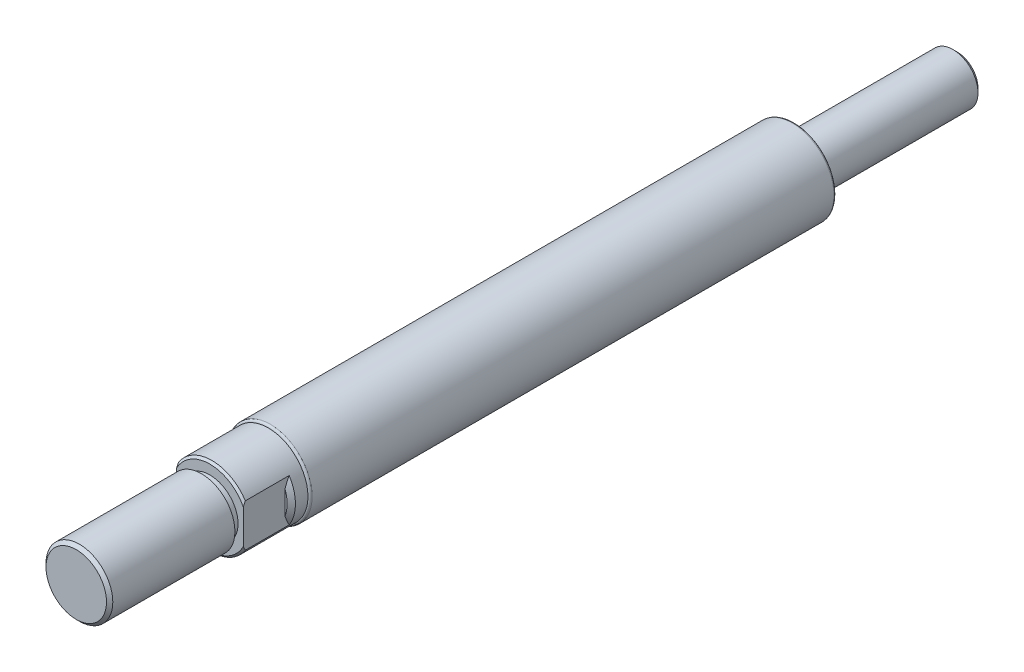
ISO-10303-21;
HEADER;
FILE_DESCRIPTION(('STEP AP214'),'2;1');
FILE_NAME('part.step','',(''),(''),'','','');
FILE_SCHEMA(('AUTOMOTIVE_DESIGN { 1 0 10303 214 1 1 1 1 }'));
ENDSEC;
DATA;
#1=APPLICATION_CONTEXT('core data for automotive mechanical design processes');
#2=APPLICATION_PROTOCOL_DEFINITION('international standard','automotive_design',2000,#1);
#3=PRODUCT_CONTEXT('',#1,'mechanical');
#4=PRODUCT('Part','Part','',(#3));
#5=PRODUCT_RELATED_PRODUCT_CATEGORY('part','',(#4));
#6=PRODUCT_DEFINITION_FORMATION('','',#4);
#7=PRODUCT_DEFINITION_CONTEXT('part definition',#1,'design');
#8=PRODUCT_DEFINITION('design','',#6,#7);
#9=PRODUCT_DEFINITION_SHAPE('','',#8);
#10=(LENGTH_UNIT() NAMED_UNIT(*) SI_UNIT(.MILLI.,.METRE.));
#11=(NAMED_UNIT(*) PLANE_ANGLE_UNIT() SI_UNIT($,.RADIAN.));
#12=(NAMED_UNIT(*) SI_UNIT($,.STERADIAN.) SOLID_ANGLE_UNIT());
#13=UNCERTAINTY_MEASURE_WITH_UNIT(LENGTH_MEASURE(1.E-05),#10,'distance_accuracy_value','');
#14=(GEOMETRIC_REPRESENTATION_CONTEXT(3) GLOBAL_UNCERTAINTY_ASSIGNED_CONTEXT((#13)) GLOBAL_UNIT_ASSIGNED_CONTEXT((#10,
#11,#12)) REPRESENTATION_CONTEXT('',''));
#15=CARTESIAN_POINT('',(0.,0.,0.));
#16=DIRECTION('',(0.,0.,1.));
#17=DIRECTION('',(1.,0.,0.));
#18=AXIS2_PLACEMENT_3D('',#15,#16,#17);
#19=CARTESIAN_POINT('',(0.,0.,-32.));
#20=DIRECTION('',(0.,0.,-1.));
#21=DIRECTION('',(-0.999999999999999,0.,0.));
#22=AXIS2_PLACEMENT_3D('',#19,#20,#21);
#23=CONICAL_SURFACE('',#22,8.99999999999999,0.785398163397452);
#24=CARTESIAN_POINT('',(-8.00000000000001,-12.4805652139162,-37.8244564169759));
#25=CARTESIAN_POINT('',(-8.00000000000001,-12.3224722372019,-37.6913618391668));
#26=CARTESIAN_POINT('',(-8.00000000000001,-12.1640190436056,-37.5586953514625));
#27=CARTESIAN_POINT('',(-8.00000000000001,-11.8463165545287,-37.2943151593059));
#28=CARTESIAN_POINT('',(-8.00000000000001,-11.6870672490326,-37.1626014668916));
#29=CARTESIAN_POINT('',(-8.00000000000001,-11.2079478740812,-36.7689821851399));
#30=CARTESIAN_POINT('',(-8.00000000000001,-10.8867753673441,-36.5086566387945));
#31=CARTESIAN_POINT('',(-8.00000000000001,-10.2380170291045,-35.9914726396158));
#32=CARTESIAN_POINT('',(-8.00000000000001,-9.91040226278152,-35.7346504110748));
#33=CARTESIAN_POINT('',(-8.00000000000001,-9.2500193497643,-35.22775645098));
#34=CARTESIAN_POINT('',(-8.00000000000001,-8.91725166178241,-34.9776841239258));
#35=CARTESIAN_POINT('',(-8.00000000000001,-8.25887278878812,-34.496113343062));
#36=CARTESIAN_POINT('',(-8.00000000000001,-7.93351298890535,-34.2642724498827));
#37=CARTESIAN_POINT('',(-8.00000000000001,-7.27552844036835,-33.810938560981));
#38=CARTESIAN_POINT('',(-8.00000000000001,-6.94290236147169,-33.5894474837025));
#39=CARTESIAN_POINT('',(-8.00000000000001,-6.26956184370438,-33.1607142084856));
#40=CARTESIAN_POINT('',(-8.00000000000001,-5.92886664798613,-32.9534419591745));
#41=CARTESIAN_POINT('',(-8.00000000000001,-5.23689572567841,-32.5574331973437));
#42=CARTESIAN_POINT('',(-8.00000000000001,-4.88562506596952,-32.3686879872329));
#43=CARTESIAN_POINT('',(-8.00000000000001,-4.3738715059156,-32.1166235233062));
#44=CARTESIAN_POINT('',(-8.00000000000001,-4.21844785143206,-32.0429980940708));
#45=CARTESIAN_POINT('',(-8.00000000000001,-3.90514290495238,-31.9011576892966));
#46=CARTESIAN_POINT('',(-8.00000000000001,-3.74726167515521,-31.8329425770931));
#47=CARTESIAN_POINT('',(-8.00000000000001,-3.42918042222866,-31.7027730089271));
#48=CARTESIAN_POINT('',(-8.00000000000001,-3.26898384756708,-31.6408101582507));
#49=CARTESIAN_POINT('',(-8.00000000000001,-2.94603757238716,-31.5238771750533));
#50=CARTESIAN_POINT('',(-8.00000000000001,-2.78328774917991,-31.4689073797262));
#51=CARTESIAN_POINT('',(-8.00000000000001,-2.45268168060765,-31.3660375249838));
#52=CARTESIAN_POINT('',(-8.00000000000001,-2.28478540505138,-31.3182653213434));
#53=CARTESIAN_POINT('',(-8.00000000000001,-1.94668439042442,-31.2318203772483));
#54=CARTESIAN_POINT('',(-8.00000000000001,-1.77648006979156,-31.1931460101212));
#55=CARTESIAN_POINT('',(-8.00000000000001,-1.43315589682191,-31.1256089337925));
#56=CARTESIAN_POINT('',(-8.00000000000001,-1.2600252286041,-31.0968006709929));
#57=CARTESIAN_POINT('',(-8.00000000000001,-0.912189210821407,-31.0499796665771));
#58=CARTESIAN_POINT('',(-8.00000000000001,-0.73748281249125,-31.0319747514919));
#59=CARTESIAN_POINT('',(-8.00000000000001,-0.562330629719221,-31.0197391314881));
#60=B_SPLINE_CURVE_WITH_KNOTS('',3,(#24,#25,#26,#27,#28,#29,#30,#31,#32,#33,#34,#35,#36,#37,#38,
#39,#40,#41,#42,#43,#44,#45,#46,#47,#48,#49,#50,#51,#52,#53,#54,#55,#56,#57,#58,#59),
.UNSPECIFIED.,.F.,.F.,(4,2,2,2,2,2,2,2,2,2,2,2,2,2,2,2,2,4),(0.,0.619972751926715,
1.23995332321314,2.48018539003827,3.72895875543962,4.97762158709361,6.17600476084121,
7.37460919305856,8.5705969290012,9.76602049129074,10.2818793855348,10.7977252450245,
11.3128690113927,11.8280376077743,12.3514878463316,12.8748444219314,13.4010442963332,
13.9276249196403),.UNSPECIFIED.);
#61=CARTESIAN_POINT('',(-8.00000000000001,-5.12347538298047,-32.5));
#62=VERTEX_POINT('',#61);
#63=CARTESIAN_POINT('',(-8.00000000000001,-4.12310562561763,-32.));
#64=VERTEX_POINT('',#63);
#65=EDGE_CURVE('E93',#62,#64,#60,.T.);
#66=ORIENTED_EDGE('',*,*,#65,.F.);
#67=CARTESIAN_POINT('',(0.,0.,-32.5));
#68=DIRECTION('',(0.,0.,-1.));
#69=DIRECTION('',(-0.999999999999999,0.,0.));
#70=AXIS2_PLACEMENT_3D('',#67,#68,#69);
#71=CIRCLE('',#70,9.5);
#72=CARTESIAN_POINT('',(8.00000000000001,-5.12347538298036,-32.5));
#73=VERTEX_POINT('',#72);
#74=EDGE_CURVE('E127',#73,#62,#71,.T.);
#75=ORIENTED_EDGE('',*,*,#74,.F.);
#76=CARTESIAN_POINT('',(8.00000000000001,-0.562330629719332,-31.0197391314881));
#77=CARTESIAN_POINT('',(7.99999999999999,-0.69295357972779,-31.0288830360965));
#78=CARTESIAN_POINT('',(7.99999999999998,-0.823340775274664,-31.0412160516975));
#79=CARTESIAN_POINT('',(7.99999999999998,-1.08335782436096,-31.071992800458));
#80=CARTESIAN_POINT('',(7.99999999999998,-1.21298787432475,-31.0904348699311));
#81=CARTESIAN_POINT('',(7.99999999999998,-1.47102175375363,-31.133125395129));
#82=CARTESIAN_POINT('',(7.99999999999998,-1.59942749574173,-31.1573623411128));
#83=CARTESIAN_POINT('',(7.99999999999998,-1.85508108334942,-31.211315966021));
#84=CARTESIAN_POINT('',(7.99999999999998,-1.98232885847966,-31.2410329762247));
#85=CARTESIAN_POINT('',(7.99999999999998,-2.35920384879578,-31.3371043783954));
#86=CARTESIAN_POINT('',(7.99999999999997,-2.6069577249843,-31.4108917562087));
#87=CARTESIAN_POINT('',(7.99999999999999,-3.09678237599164,-31.5753571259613));
#88=CARTESIAN_POINT('',(8.00000000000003,-3.33885159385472,-31.6660396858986));
#89=CARTESIAN_POINT('',(8.,-3.65836579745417,-31.7964917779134));
#90=CARTESIAN_POINT('',(7.99999999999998,-3.73838694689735,-31.8300828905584));
#91=CARTESIAN_POINT('',(7.99999999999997,-3.89777984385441,-31.8987366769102));
#92=CARTESIAN_POINT('',(7.99999999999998,-3.97715171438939,-31.9337990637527));
#93=CARTESIAN_POINT('',(7.99999999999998,-4.13548600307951,-32.0054007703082));
#94=CARTESIAN_POINT('',(7.99999999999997,-4.21444671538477,-32.0419438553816));
#95=CARTESIAN_POINT('',(7.99999999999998,-4.37174909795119,-32.1163258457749));
#96=CARTESIAN_POINT('',(8.,-4.45009079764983,-32.1541646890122));
#97=CARTESIAN_POINT('',(8.00000000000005,-4.89771562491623,-32.3746464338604));
#98=CARTESIAN_POINT('',(8.,-5.26067807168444,-32.5702240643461));
#99=CARTESIAN_POINT('',(7.99999999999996,-5.97540383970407,-32.9809788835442));
#100=CARTESIAN_POINT('',(7.99999999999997,-6.32716009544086,-33.1961681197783));
#101=CARTESIAN_POINT('',(7.99999999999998,-7.02247411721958,-33.6416036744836));
#102=CARTESIAN_POINT('',(7.99999999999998,-7.36600352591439,-33.8718940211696));
#103=CARTESIAN_POINT('',(7.99999999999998,-8.04542815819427,-34.3432410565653));
#104=CARTESIAN_POINT('',(7.99999999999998,-8.38132509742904,-34.5842952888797));
#105=CARTESIAN_POINT('',(7.99999999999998,-9.03826974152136,-35.0682362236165));
#106=CARTESIAN_POINT('',(7.99999999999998,-9.35947580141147,-35.3109088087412));
#107=CARTESIAN_POINT('',(7.99999999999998,-9.99716232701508,-35.8024231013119));
#108=CARTESIAN_POINT('',(7.99999999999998,-10.3136423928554,-36.0512653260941));
#109=CARTESIAN_POINT('',(7.99999999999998,-10.9403768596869,-36.5519926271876));
#110=CARTESIAN_POINT('',(7.99999999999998,-11.250659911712,-36.8038419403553));
#111=CARTESIAN_POINT('',(7.99999999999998,-11.8679206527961,-37.3114344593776));
#112=CARTESIAN_POINT('',(7.99999999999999,-12.1748990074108,-37.5671768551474));
#113=CARTESIAN_POINT('',(8.00000000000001,-12.4805652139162,-37.8244564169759));
#114=B_SPLINE_CURVE_WITH_KNOTS('',3,(#76,#77,#78,#79,#80,#81,#82,#83,#84,#85,#86,#87,#88,#89,
#90,#91,#92,#93,#94,#95,#96,#97,#98,#99,#100,#101,#102,#103,#104,#105,#106,#107,#108,#109,#110,
#111,#112,#113),.UNSPECIFIED.,.F.,.F.,(4,2,2,2,2,2,2,2,2,2,2,2,2,2,2,2,2,2,4),(0.,
0.392770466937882,0.785434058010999,1.17732412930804,1.56923789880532,2.34397803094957,
3.11892793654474,3.37927663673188,3.6395748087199,3.9005825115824,4.16157772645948,
5.3974810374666,6.63414875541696,7.87459784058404,9.11476527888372,10.3223857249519,
11.5301077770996,12.7289611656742,13.9275684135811),.UNSPECIFIED.);
#115=CARTESIAN_POINT('',(8.00000000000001,-4.1231056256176,-32.));
#116=VERTEX_POINT('',#115);
#117=EDGE_CURVE('E118',#116,#73,#114,.T.);
#118=ORIENTED_EDGE('',*,*,#117,.F.);
#119=CARTESIAN_POINT('',(0.,0.,-32.));
#120=DIRECTION('',(0.,0.,-1.));
#121=DIRECTION('',(-0.999999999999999,0.,0.));
#122=AXIS2_PLACEMENT_3D('',#119,#120,#121);
#123=CIRCLE('',#122,8.99999999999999);
#124=EDGE_CURVE('E111',#64,#116,#123,.F.);
#125=ORIENTED_EDGE('',*,*,#124,.F.);
#126=EDGE_LOOP('',(#66,#75,#118,#125));
#127=FACE_BOUND('',#126,.T.);
#128=ADVANCED_FACE('F26',(#127),#23,.T.);
#129=CARTESIAN_POINT('',(0.,1.38777878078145E-13,0.));
#130=DIRECTION('',(0.,0.,-1.));
#131=DIRECTION('',(-0.999999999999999,0.,0.));
#132=AXIS2_PLACEMENT_3D('',#129,#130,#131);
#133=PLANE('',#132);
#134=CARTESIAN_POINT('',(0.,1.38777878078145E-13,0.));
#135=DIRECTION('',(0.,0.,-1.));
#136=DIRECTION('',(-0.999999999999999,0.,0.));
#137=AXIS2_PLACEMENT_3D('',#134,#135,#136);
#138=CIRCLE('',#137,7.25);
#139=CARTESIAN_POINT('',(-7.24999999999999,1.38638354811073E-13,0.));
#140=VERTEX_POINT('',#139);
#141=EDGE_CURVE('E123',#140,#140,#138,.F.);
#142=ORIENTED_EDGE('',*,*,#141,.T.);
#143=EDGE_LOOP('',(#142));
#144=FACE_BOUND('',#143,.T.);
#145=ADVANCED_FACE('F28',(#144),#133,.F.);
#146=CARTESIAN_POINT('',(0.,1.11022302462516E-13,30.));
#147=DIRECTION('',(0.,0.,1.));
#148=DIRECTION('',(0.999999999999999,0.,0.));
#149=AXIS2_PLACEMENT_3D('',#146,#147,#148);
#150=CYLINDRICAL_SURFACE('',#149,8.);
#151=CARTESIAN_POINT('',(0.,1.38777878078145E-13,-0.750000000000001));
#152=DIRECTION('',(0.,0.,-1.));
#153=DIRECTION('',(-0.999999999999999,0.,0.));
#154=AXIS2_PLACEMENT_3D('',#151,#152,#153);
#155=CIRCLE('',#154,8.);
#156=CARTESIAN_POINT('',(-7.99999999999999,1.38623921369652E-13,-0.750000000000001));
#157=VERTEX_POINT('',#156);
#158=EDGE_CURVE('E119',#157,#157,#155,.T.);
#159=ORIENTED_EDGE('',*,*,#158,.T.);
#160=EDGE_LOOP('',(#159));
#161=FACE_BOUND('',#160,.T.);
#162=CARTESIAN_POINT('',(0.,0.,-30.));
#163=DIRECTION('',(0.,0.,1.));
#164=DIRECTION('',(0.999999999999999,0.,0.));
#165=AXIS2_PLACEMENT_3D('',#162,#163,#164);
#166=CIRCLE('',#165,8.);
#167=CARTESIAN_POINT('',(7.99999999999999,0.,-30.));
#168=VERTEX_POINT('',#167);
#169=EDGE_CURVE('E251',#168,#168,#166,.T.);
#170=ORIENTED_EDGE('',*,*,#169,.T.);
#171=EDGE_LOOP('',(#170));
#172=FACE_BOUND('',#171,.T.);
#173=ADVANCED_FACE('F277',(#161,#172),#150,.T.);
#174=CARTESIAN_POINT('',(0.,8.00000000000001,-30.));
#175=DIRECTION('',(0.,0.,1.));
#176=DIRECTION('',(0.999999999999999,0.,0.));
#177=AXIS2_PLACEMENT_3D('',#174,#175,#176);
#178=PLANE('',#177);
#179=ORIENTED_EDGE('',*,*,#169,.F.);
#180=EDGE_LOOP('',(#179));
#181=FACE_BOUND('',#180,.T.);
#182=CARTESIAN_POINT('',(0.,0.,-30.));
#183=DIRECTION('',(0.,0.,1.));
#184=DIRECTION('',(0.999999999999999,0.,0.));
#185=AXIS2_PLACEMENT_3D('',#182,#183,#184);
#186=CIRCLE('',#185,6.75);
#187=CARTESIAN_POINT('',(6.74999999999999,0.,-30.));
#188=VERTEX_POINT('',#187);
#189=EDGE_CURVE('E248',#188,#188,#186,.T.);
#190=ORIENTED_EDGE('',*,*,#189,.T.);
#191=EDGE_LOOP('',(#190));
#192=FACE_BOUND('',#191,.T.);
#193=ADVANCED_FACE('F281',(#181,#192),#178,.F.);
#194=CARTESIAN_POINT('',(0.,1.11022302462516E-13,30.));
#195=DIRECTION('',(0.,0.,1.));
#196=DIRECTION('',(0.999999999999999,0.,0.));
#197=AXIS2_PLACEMENT_3D('',#194,#195,#196);
#198=CYLINDRICAL_SURFACE('',#197,6.75);
#199=ORIENTED_EDGE('',*,*,#189,.F.);
#200=EDGE_LOOP('',(#199));
#201=FACE_BOUND('',#200,.T.);
#202=CARTESIAN_POINT('',(0.,0.,-32.));
#203=DIRECTION('',(0.,0.,1.));
#204=DIRECTION('',(0.999999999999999,0.,0.));
#205=AXIS2_PLACEMENT_3D('',#202,#203,#204);
#206=CIRCLE('',#205,6.75);
#207=CARTESIAN_POINT('',(6.74999999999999,0.,-32.));
#208=VERTEX_POINT('',#207);
#209=EDGE_CURVE('E245',#208,#208,#206,.T.);
#210=ORIENTED_EDGE('',*,*,#209,.T.);
#211=EDGE_LOOP('',(#210));
#212=FACE_BOUND('',#211,.T.);
#213=ADVANCED_FACE('F286',(#201,#212),#198,.T.);
#214=CARTESIAN_POINT('',(0.,6.75000000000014,-32.));
#215=DIRECTION('',(0.,0.,-1.));
#216=DIRECTION('',(-0.999999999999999,0.,0.));
#217=AXIS2_PLACEMENT_3D('',#214,#215,#216);
#218=PLANE('',#217);
#219=CARTESIAN_POINT('',(8.00000000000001,4.12310562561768,-32.));
#220=VERTEX_POINT('',#219);
#221=CARTESIAN_POINT('',(-8.00000000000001,4.12310562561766,-32.));
#222=VERTEX_POINT('',#221);
#223=EDGE_CURVE('E114',#220,#222,#123,.F.);
#224=ORIENTED_EDGE('',*,*,#223,.T.);
#225=DIRECTION('',(0.,0.999999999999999,0.));
#226=VECTOR('',#225,1.);
#227=CARTESIAN_POINT('',(-8.00000000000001,6.00000000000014,-32.));
#228=LINE('',#227,#226);
#229=EDGE_CURVE('E96',#64,#222,#228,.T.);
#230=ORIENTED_EDGE('',*,*,#229,.F.);
#231=ORIENTED_EDGE('',*,*,#124,.T.);
#232=DIRECTION('',(0.,-0.999999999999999,0.));
#233=VECTOR('',#232,1.);
#234=CARTESIAN_POINT('',(8.00000000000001,6.00000000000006,-32.));
#235=LINE('',#234,#233);
#236=EDGE_CURVE('E222',#220,#116,#235,.T.);
#237=ORIENTED_EDGE('',*,*,#236,.F.);
#238=EDGE_LOOP('',(#224,#230,#231,#237));
#239=FACE_BOUND('',#238,.T.);
#240=ORIENTED_EDGE('',*,*,#209,.F.);
#241=EDGE_LOOP('',(#240));
#242=FACE_BOUND('',#241,.T.);
#243=ADVANCED_FACE('F108',(#239,#242),#218,.F.);
#244=CARTESIAN_POINT('',(0.,1.11022302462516E-13,30.));
#245=DIRECTION('',(0.,0.,1.));
#246=DIRECTION('',(0.999999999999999,0.,0.));
#247=AXIS2_PLACEMENT_3D('',#244,#245,#246);
#248=CYLINDRICAL_SURFACE('',#247,9.5);
#249=DIRECTION('',(0.,0.,1.));
#250=VECTOR('',#249,1.);
#251=CARTESIAN_POINT('',(8.00000000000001,5.1234753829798,30.));
#252=LINE('',#251,#250);
#253=CARTESIAN_POINT('',(8.00000000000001,5.1234753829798,-32.5));
#254=VERTEX_POINT('',#253);
#255=CARTESIAN_POINT('',(8.00000000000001,5.12347538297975,-43.));
#256=VERTEX_POINT('',#255);
#257=EDGE_CURVE('E221',#254,#256,#252,.F.);
#258=ORIENTED_EDGE('',*,*,#257,.T.);
#259=CARTESIAN_POINT('',(0.,0.,-43.));
#260=DIRECTION('',(0.,0.,1.));
#261=DIRECTION('',(0.999999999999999,0.,0.));
#262=AXIS2_PLACEMENT_3D('',#259,#260,#261);
#263=CIRCLE('',#262,9.5);
#264=CARTESIAN_POINT('',(8.00000000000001,-5.12347538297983,-43.));
#265=VERTEX_POINT('',#264);
#266=EDGE_CURVE('E226',#256,#265,#263,.F.);
#267=ORIENTED_EDGE('',*,*,#266,.T.);
#268=DIRECTION('',(0.,0.,1.));
#269=VECTOR('',#268,1.);
#270=CARTESIAN_POINT('',(7.99999999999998,-5.12347538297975,30.));
#271=LINE('',#270,#269);
#272=EDGE_CURVE('E215',#265,#73,#271,.T.);
#273=ORIENTED_EDGE('',*,*,#272,.T.);
#274=ORIENTED_EDGE('',*,*,#74,.T.);
#275=DIRECTION('',(0.,0.,1.));
#276=VECTOR('',#275,1.);
#277=CARTESIAN_POINT('',(-8.00000000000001,-5.12347538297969,30.));
#278=LINE('',#277,#276);
#279=CARTESIAN_POINT('',(-8.00000000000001,-5.12347538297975,-43.));
#280=VERTEX_POINT('',#279);
#281=EDGE_CURVE('E98',#62,#280,#278,.F.);
#282=ORIENTED_EDGE('',*,*,#281,.T.);
#283=CARTESIAN_POINT('',(0.,0.,-43.));
#284=DIRECTION('',(0.,0.,-1.));
#285=DIRECTION('',(-0.999999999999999,0.,0.));
#286=AXIS2_PLACEMENT_3D('',#283,#284,#285);
#287=CIRCLE('',#286,9.5);
#288=CARTESIAN_POINT('',(-8.00000000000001,5.12347538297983,-43.));
#289=VERTEX_POINT('',#288);
#290=EDGE_CURVE('E224',#280,#289,#287,.T.);
#291=ORIENTED_EDGE('',*,*,#290,.T.);
#292=DIRECTION('',(0.,0.,1.));
#293=VECTOR('',#292,1.);
#294=CARTESIAN_POINT('',(-8.00000000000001,5.12347538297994,30.));
#295=LINE('',#294,#293);
#296=CARTESIAN_POINT('',(-8.00000000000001,5.12347538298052,-32.5));
#297=VERTEX_POINT('',#296);
#298=EDGE_CURVE('E353',#289,#297,#295,.T.);
#299=ORIENTED_EDGE('',*,*,#298,.T.);
#300=EDGE_CURVE('E121',#297,#254,#71,.T.);
#301=ORIENTED_EDGE('',*,*,#300,.T.);
#302=EDGE_LOOP('',(#258,#267,#273,#274,#282,#291,#299,#301));
#303=FACE_BOUND('',#302,.T.);
#304=CARTESIAN_POINT('',(0.,0.,-46.));
#305=DIRECTION('',(0.,0.,1.));
#306=DIRECTION('',(0.999999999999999,0.,0.));
#307=AXIS2_PLACEMENT_3D('',#304,#305,#306);
#308=CIRCLE('',#307,9.5);
#309=CARTESIAN_POINT('',(9.49999999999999,0.,-46.));
#310=VERTEX_POINT('',#309);
#311=EDGE_CURVE('E242',#310,#310,#308,.T.);
#312=ORIENTED_EDGE('',*,*,#311,.T.);
#313=EDGE_LOOP('',(#312));
#314=FACE_BOUND('',#313,.T.);
#315=ADVANCED_FACE('F229',(#303,#314),#248,.T.);
#316=CARTESIAN_POINT('',(0.,1.11022302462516E-13,30.));
#317=DIRECTION('',(0.,0.,1.));
#318=DIRECTION('',(0.999999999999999,0.,0.));
#319=AXIS2_PLACEMENT_3D('',#316,#317,#318);
#320=CYLINDRICAL_SURFACE('',#319,10.);
#321=CARTESIAN_POINT('',(0.,0.,-46.5));
#322=DIRECTION('',(0.,0.,-1.));
#323=DIRECTION('',(-0.999999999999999,0.,0.));
#324=AXIS2_PLACEMENT_3D('',#321,#322,#323);
#325=CIRCLE('',#324,10.);
#326=CARTESIAN_POINT('',(-9.99999999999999,0.,-46.5));
#327=VERTEX_POINT('',#326);
#328=EDGE_CURVE('E132',#327,#327,#325,.T.);
#329=ORIENTED_EDGE('',*,*,#328,.T.);
#330=EDGE_LOOP('',(#329));
#331=FACE_BOUND('',#330,.T.);
#332=CARTESIAN_POINT('',(0.,0.,-171.5));
#333=DIRECTION('',(0.,0.,1.));
#334=DIRECTION('',(0.999999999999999,0.,0.));
#335=AXIS2_PLACEMENT_3D('',#332,#333,#334);
#336=CIRCLE('',#335,10.);
#337=CARTESIAN_POINT('',(9.99999999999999,0.,-171.5));
#338=VERTEX_POINT('',#337);
#339=EDGE_CURVE('E129',#338,#338,#336,.T.);
#340=ORIENTED_EDGE('',*,*,#339,.T.);
#341=EDGE_LOOP('',(#340));
#342=FACE_BOUND('',#341,.T.);
#343=ADVANCED_FACE('F298',(#331,#342),#320,.T.);
#344=CARTESIAN_POINT('',(0.,10.,-172.));
#345=DIRECTION('',(0.,0.,1.));
#346=DIRECTION('',(0.999999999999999,0.,0.));
#347=AXIS2_PLACEMENT_3D('',#344,#345,#346);
#348=PLANE('',#347);
#349=CARTESIAN_POINT('',(0.,0.,-172.));
#350=DIRECTION('',(0.,0.,1.));
#351=DIRECTION('',(0.999999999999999,0.,0.));
#352=AXIS2_PLACEMENT_3D('',#349,#350,#351);
#353=CIRCLE('',#352,9.5);
#354=CARTESIAN_POINT('',(9.49999999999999,0.,-172.));
#355=VERTEX_POINT('',#354);
#356=EDGE_CURVE('E135',#355,#355,#353,.F.);
#357=ORIENTED_EDGE('',*,*,#356,.T.);
#358=EDGE_LOOP('',(#357));
#359=FACE_BOUND('',#358,.T.);
#360=CARTESIAN_POINT('',(0.,0.,-172.));
#361=DIRECTION('',(0.,0.,1.));
#362=DIRECTION('',(0.999999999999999,0.,0.));
#363=AXIS2_PLACEMENT_3D('',#360,#361,#362);
#364=CIRCLE('',#363,6.);
#365=CARTESIAN_POINT('',(5.99999999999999,0.,-172.));
#366=VERTEX_POINT('',#365);
#367=EDGE_CURVE('E236',#366,#366,#364,.T.);
#368=ORIENTED_EDGE('',*,*,#367,.T.);
#369=EDGE_LOOP('',(#368));
#370=FACE_BOUND('',#369,.T.);
#371=ADVANCED_FACE('F301',(#359,#370),#348,.F.);
#372=CARTESIAN_POINT('',(0.,1.11022302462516E-13,30.));
#373=DIRECTION('',(0.,0.,1.));
#374=DIRECTION('',(0.999999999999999,0.,0.));
#375=AXIS2_PLACEMENT_3D('',#372,#373,#374);
#376=CYLINDRICAL_SURFACE('',#375,6.);
#377=CARTESIAN_POINT('',(0.,0.,-210.));
#378=DIRECTION('',(0.,0.,1.));
#379=DIRECTION('',(0.999999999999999,0.,0.));
#380=AXIS2_PLACEMENT_3D('',#377,#378,#379);
#381=CIRCLE('',#380,6.);
#382=CARTESIAN_POINT('',(5.99999999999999,0.,-210.));
#383=VERTEX_POINT('',#382);
#384=EDGE_CURVE('E138',#383,#383,#381,.T.);
#385=ORIENTED_EDGE('',*,*,#384,.T.);
#386=EDGE_LOOP('',(#385));
#387=FACE_BOUND('',#386,.T.);
#388=ORIENTED_EDGE('',*,*,#367,.F.);
#389=EDGE_LOOP('',(#388));
#390=FACE_BOUND('',#389,.T.);
#391=ADVANCED_FACE('F267',(#387,#390),#376,.T.);
#392=CARTESIAN_POINT('',(0.,6.00000000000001,-211.));
#393=DIRECTION('',(0.,0.,1.));
#394=DIRECTION('',(0.999999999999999,0.,0.));
#395=AXIS2_PLACEMENT_3D('',#392,#393,#394);
#396=PLANE('',#395);
#397=CARTESIAN_POINT('',(0.,0.,-211.));
#398=DIRECTION('',(0.,0.,1.));
#399=DIRECTION('',(0.999999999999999,0.,0.));
#400=AXIS2_PLACEMENT_3D('',#397,#398,#399);
#401=CIRCLE('',#400,4.99999999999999);
#402=CARTESIAN_POINT('',(4.99999999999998,0.,-211.));
#403=VERTEX_POINT('',#402);
#404=EDGE_CURVE('E141',#403,#403,#401,.F.);
#405=ORIENTED_EDGE('',*,*,#404,.T.);
#406=EDGE_LOOP('',(#405));
#407=FACE_BOUND('',#406,.T.);
#408=ADVANCED_FACE('F259',(#407),#396,.F.);
#409=CARTESIAN_POINT('',(0.,1.38777878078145E-13,0.));
#410=DIRECTION('',(0.,0.,-1.));
#411=DIRECTION('',(-0.999999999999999,0.,0.));
#412=AXIS2_PLACEMENT_3D('',#409,#410,#411);
#413=CONICAL_SURFACE('',#412,7.25,0.785398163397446);
#414=ORIENTED_EDGE('',*,*,#158,.F.);
#415=EDGE_LOOP('',(#414));
#416=FACE_BOUND('',#415,.T.);
#417=ORIENTED_EDGE('',*,*,#141,.F.);
#418=EDGE_LOOP('',(#417));
#419=FACE_BOUND('',#418,.T.);
#420=ADVANCED_FACE('F257',(#416,#419),#413,.T.);
#421=CARTESIAN_POINT('',(-8.00000000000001,0.562330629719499,-31.0197391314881));
#422=CARTESIAN_POINT('',(-8.00000000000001,0.692953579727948,-31.0288830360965));
#423=CARTESIAN_POINT('',(-8.00000000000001,0.823340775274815,-31.0412160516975));
#424=CARTESIAN_POINT('',(-8.00000000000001,1.0833578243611,-31.071992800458));
#425=CARTESIAN_POINT('',(-8.00000000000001,1.21298787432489,-31.0904348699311));
#426=CARTESIAN_POINT('',(-8.00000000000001,1.47102175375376,-31.133125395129));
#427=CARTESIAN_POINT('',(-8.00000000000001,1.59942749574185,-31.1573623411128));
#428=CARTESIAN_POINT('',(-8.00000000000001,1.85508108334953,-31.211315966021));
#429=CARTESIAN_POINT('',(-8.00000000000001,1.98232885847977,-31.2410329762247));
#430=CARTESIAN_POINT('',(-8.00000000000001,2.35920384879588,-31.3371043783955));
#431=CARTESIAN_POINT('',(-8.00000000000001,2.60695772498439,-31.4108917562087));
#432=CARTESIAN_POINT('',(-8.00000000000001,3.09678237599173,-31.5753571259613));
#433=CARTESIAN_POINT('',(-8.00000000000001,3.33885159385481,-31.6660396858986));
#434=CARTESIAN_POINT('',(-8.00000000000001,3.65836579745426,-31.7964917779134));
#435=CARTESIAN_POINT('',(-8.00000000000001,3.73838694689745,-31.8300828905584));
#436=CARTESIAN_POINT('',(-8.00000000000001,3.89777984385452,-31.8987366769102));
#437=CARTESIAN_POINT('',(-8.00000000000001,3.97715171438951,-31.9337990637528));
#438=CARTESIAN_POINT('',(-8.00000000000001,4.13548600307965,-32.0054007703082));
#439=CARTESIAN_POINT('',(-8.00000000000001,4.21444671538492,-32.0419438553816));
#440=CARTESIAN_POINT('',(-8.00000000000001,4.37174909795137,-32.1163258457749));
#441=CARTESIAN_POINT('',(-8.00000000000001,4.45009079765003,-32.1541646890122));
#442=CARTESIAN_POINT('',(-8.00000000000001,4.89771562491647,-32.3746464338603));
#443=CARTESIAN_POINT('',(-8.00000000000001,5.26067807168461,-32.5702240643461));
#444=CARTESIAN_POINT('',(-8.00000000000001,5.97540383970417,-32.9809788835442));
#445=CARTESIAN_POINT('',(-8.00000000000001,6.32716009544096,-33.1961681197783));
#446=CARTESIAN_POINT('',(-8.00000000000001,7.02247411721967,-33.6416036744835));
#447=CARTESIAN_POINT('',(-8.00000000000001,7.36600352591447,-33.8718940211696));
#448=CARTESIAN_POINT('',(-8.00000000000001,8.04542815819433,-34.3432410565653));
#449=CARTESIAN_POINT('',(-8.00000000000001,8.38132509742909,-34.5842952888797));
#450=CARTESIAN_POINT('',(-8.00000000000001,9.03826974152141,-35.0682362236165));
#451=CARTESIAN_POINT('',(-8.00000000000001,9.35947580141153,-35.3109088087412));
#452=CARTESIAN_POINT('',(-8.00000000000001,9.99716232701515,-35.8024231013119));
#453=CARTESIAN_POINT('',(-8.00000000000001,10.3136423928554,-36.0512653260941));
#454=CARTESIAN_POINT('',(-8.00000000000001,10.9403768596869,-36.5519926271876));
#455=CARTESIAN_POINT('',(-8.00000000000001,11.2506599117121,-36.8038419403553));
#456=CARTESIAN_POINT('',(-8.00000000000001,11.8679206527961,-37.3114344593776));
#457=CARTESIAN_POINT('',(-8.00000000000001,12.1748990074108,-37.5671768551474));
#458=CARTESIAN_POINT('',(-8.00000000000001,12.4805652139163,-37.8244564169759));
#459=B_SPLINE_CURVE_WITH_KNOTS('',3,(#421,#422,#423,#424,#425,#426,#427,#428,#429,#430,#431,
#432,#433,#434,#435,#436,#437,#438,#439,#440,#441,#442,#443,#444,#445,#446,#447,#448,#449,#450,
#451,#452,#453,#454,#455,#456,#457,#458),.UNSPECIFIED.,.F.,.F.,(4,2,2,2,2,2,2,2,2,2,2,2,2,2,2,2,
2,2,4),(0.,0.392770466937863,0.785434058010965,1.17732412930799,1.56923789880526,
2.34397803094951,3.11892793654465,3.37927663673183,3.63957480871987,3.9005825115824,
4.16157772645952,5.39748103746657,6.63414875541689,7.87459784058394,9.11476527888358,
10.3223857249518,11.5301077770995,12.7289611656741,13.927568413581),.UNSPECIFIED.);
#460=EDGE_CURVE('E104',#222,#297,#459,.T.);
#461=ORIENTED_EDGE('',*,*,#460,.F.);
#462=ORIENTED_EDGE('',*,*,#223,.F.);
#463=CARTESIAN_POINT('',(8.00000000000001,12.4805652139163,-37.8244564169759));
#464=CARTESIAN_POINT('',(7.99999999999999,12.322472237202,-37.6913618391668));
#465=CARTESIAN_POINT('',(7.99999999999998,12.1640190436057,-37.5586953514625));
#466=CARTESIAN_POINT('',(7.99999999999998,11.8463165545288,-37.2943151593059));
#467=CARTESIAN_POINT('',(7.99999999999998,11.6870672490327,-37.1626014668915));
#468=CARTESIAN_POINT('',(7.99999999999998,11.2079478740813,-36.7689821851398));
#469=CARTESIAN_POINT('',(7.99999999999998,10.8867753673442,-36.5086566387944));
#470=CARTESIAN_POINT('',(7.99999999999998,10.2380170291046,-35.9914726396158));
#471=CARTESIAN_POINT('',(7.99999999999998,9.91040226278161,-35.7346504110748));
#472=CARTESIAN_POINT('',(7.99999999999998,9.25001934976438,-35.22775645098));
#473=CARTESIAN_POINT('',(7.99999999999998,8.9172516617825,-34.9776841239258));
#474=CARTESIAN_POINT('',(7.99999999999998,8.25887278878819,-34.496113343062));
#475=CARTESIAN_POINT('',(7.99999999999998,7.93351298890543,-34.2642724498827));
#476=CARTESIAN_POINT('',(7.99999999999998,7.27552844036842,-33.810938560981));
#477=CARTESIAN_POINT('',(7.99999999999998,6.94290236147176,-33.5894474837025));
#478=CARTESIAN_POINT('',(7.99999999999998,6.26956184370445,-33.1607142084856));
#479=CARTESIAN_POINT('',(7.99999999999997,5.92886664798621,-32.9534419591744));
#480=CARTESIAN_POINT('',(7.99999999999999,5.23689572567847,-32.5574331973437));
#481=CARTESIAN_POINT('',(8.00000000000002,4.88562506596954,-32.3686879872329));
#482=CARTESIAN_POINT('',(8.,4.37387150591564,-32.1166235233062));
#483=CARTESIAN_POINT('',(7.99999999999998,4.21844785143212,-32.0429980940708));
#484=CARTESIAN_POINT('',(7.99999999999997,3.90514290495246,-31.9011576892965));
#485=CARTESIAN_POINT('',(7.99999999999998,3.74726167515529,-31.8329425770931));
#486=CARTESIAN_POINT('',(7.99999999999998,3.42918042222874,-31.702773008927));
#487=CARTESIAN_POINT('',(7.99999999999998,3.26898384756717,-31.6408101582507));
#488=CARTESIAN_POINT('',(7.99999999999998,2.94603757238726,-31.5238771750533));
#489=CARTESIAN_POINT('',(7.99999999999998,2.78328774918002,-31.4689073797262));
#490=CARTESIAN_POINT('',(7.99999999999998,2.45268168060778,-31.3660375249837));
#491=CARTESIAN_POINT('',(7.99999999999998,2.28478540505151,-31.3182653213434));
#492=CARTESIAN_POINT('',(7.99999999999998,1.94668439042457,-31.2318203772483));
#493=CARTESIAN_POINT('',(7.99999999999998,1.77648006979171,-31.1931460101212));
#494=CARTESIAN_POINT('',(7.99999999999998,1.43315589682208,-31.1256089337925));
#495=CARTESIAN_POINT('',(7.99999999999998,1.26002522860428,-31.0968006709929));
#496=CARTESIAN_POINT('',(7.99999999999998,0.912189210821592,-31.0499796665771));
#497=CARTESIAN_POINT('',(7.99999999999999,0.73748281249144,-31.0319747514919));
#498=CARTESIAN_POINT('',(8.00000000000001,0.562330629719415,-31.0197391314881));
#499=B_SPLINE_CURVE_WITH_KNOTS('',3,(#463,#464,#465,#466,#467,#468,#469,#470,#471,#472,#473,
#474,#475,#476,#477,#478,#479,#480,#481,#482,#483,#484,#485,#486,#487,#488,#489,#490,#491,#492,
#493,#494,#495,#496,#497,#498),.UNSPECIFIED.,.F.,.F.,(4,2,2,2,2,2,2,2,2,2,2,2,2,2,2,2,2,4),(0.,
0.619972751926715,1.23995332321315,2.48018539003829,3.72895875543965,4.97762158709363,
6.17600476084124,7.3746091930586,8.57059692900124,9.76602049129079,10.2818793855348,
10.7977252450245,11.3128690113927,11.8280376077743,12.3514878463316,12.8748444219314,
13.4010442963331,13.9276249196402),.UNSPECIFIED.);
#500=EDGE_CURVE('E144',#254,#220,#499,.T.);
#501=ORIENTED_EDGE('',*,*,#500,.F.);
#502=ORIENTED_EDGE('',*,*,#300,.F.);
#503=EDGE_LOOP('',(#461,#462,#501,#502));
#504=FACE_BOUND('',#503,.T.);
#505=ADVANCED_FACE('F155',(#504),#23,.T.);
#506=CARTESIAN_POINT('',(0.,0.,-46.5));
#507=DIRECTION('',(0.,0.,-1.));
#508=DIRECTION('',(-0.999999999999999,0.,0.));
#509=AXIS2_PLACEMENT_3D('',#506,#507,#508);
#510=TOROIDAL_SURFACE('',#509,9.5,0.5);
#511=ORIENTED_EDGE('',*,*,#328,.F.);
#512=EDGE_LOOP('',(#511));
#513=FACE_BOUND('',#512,.T.);
#514=ORIENTED_EDGE('',*,*,#311,.F.);
#515=EDGE_LOOP('',(#514));
#516=FACE_BOUND('',#515,.T.);
#517=ADVANCED_FACE('F265',(#513,#516),#510,.T.);
#518=CARTESIAN_POINT('',(0.,0.,-171.5));
#519=DIRECTION('',(0.,0.,1.));
#520=DIRECTION('',(0.999999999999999,0.,0.));
#521=AXIS2_PLACEMENT_3D('',#518,#519,#520);
#522=TOROIDAL_SURFACE('',#521,9.5,0.5);
#523=ORIENTED_EDGE('',*,*,#356,.F.);
#524=EDGE_LOOP('',(#523));
#525=FACE_BOUND('',#524,.T.);
#526=ORIENTED_EDGE('',*,*,#339,.F.);
#527=EDGE_LOOP('',(#526));
#528=FACE_BOUND('',#527,.T.);
#529=ADVANCED_FACE('F315',(#525,#528),#522,.T.);
#530=CARTESIAN_POINT('',(0.,0.,-210.));
#531=DIRECTION('',(0.,0.,1.));
#532=DIRECTION('',(0.999999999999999,0.,0.));
#533=AXIS2_PLACEMENT_3D('',#530,#531,#532);
#534=CONICAL_SURFACE('',#533,6.,0.785398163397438);
#535=ORIENTED_EDGE('',*,*,#404,.F.);
#536=EDGE_LOOP('',(#535));
#537=FACE_BOUND('',#536,.T.);
#538=ORIENTED_EDGE('',*,*,#384,.F.);
#539=EDGE_LOOP('',(#538));
#540=FACE_BOUND('',#539,.T.);
#541=ADVANCED_FACE('F167',(#537,#540),#534,.T.);
#542=CARTESIAN_POINT('',(0.,0.,-42.));
#543=DIRECTION('',(0.,0.,1.));
#544=DIRECTION('',(0.999999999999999,0.,0.));
#545=AXIS2_PLACEMENT_3D('',#542,#543,#544);
#546=PLANE('',#545);
#547=DIRECTION('',(0.,-0.999999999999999,0.));
#548=VECTOR('',#547,1.);
#549=CARTESIAN_POINT('',(7.99999999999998,6.00000000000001,-42.));
#550=LINE('',#549,#548);
#551=CARTESIAN_POINT('',(8.00000000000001,2.87228132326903,-42.));
#552=VERTEX_POINT('',#551);
#553=CARTESIAN_POINT('',(8.00000000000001,-2.87228132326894,-42.));
#554=VERTEX_POINT('',#553);
#555=EDGE_CURVE('E213',#552,#554,#550,.T.);
#556=ORIENTED_EDGE('',*,*,#555,.T.);
#557=CARTESIAN_POINT('',(0.,0.,-42.));
#558=DIRECTION('',(0.,0.,1.));
#559=DIRECTION('',(0.999999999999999,0.,0.));
#560=AXIS2_PLACEMENT_3D('',#557,#558,#559);
#561=CIRCLE('',#560,8.49999999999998);
#562=EDGE_CURVE('E103',#554,#552,#561,.T.);
#563=ORIENTED_EDGE('',*,*,#562,.T.);
#564=EDGE_LOOP('',(#556,#563));
#565=FACE_BOUND('',#564,.T.);
#566=ADVANCED_FACE('F165',(#565),#546,.T.);
#567=CARTESIAN_POINT('',(7.99999999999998,6.00000000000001,-42.));
#568=DIRECTION('',(-0.999999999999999,0.,0.));
#569=DIRECTION('',(0.,0.,1.));
#570=AXIS2_PLACEMENT_3D('',#567,#568,#569);
#571=PLANE('',#570);
#572=ORIENTED_EDGE('',*,*,#555,.F.);
#573=CARTESIAN_POINT('',(8.00000000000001,2.87228132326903,-42.));
#574=CARTESIAN_POINT('',(7.99999999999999,3.06722326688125,-42.0658885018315));
#575=CARTESIAN_POINT('',(7.99999999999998,3.26030628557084,-42.1370606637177));
#576=CARTESIAN_POINT('',(7.99999999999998,3.64250565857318,-42.2884612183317));
#577=CARTESIAN_POINT('',(7.99999999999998,3.83162841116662,-42.3686734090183));
#578=CARTESIAN_POINT('',(7.99999999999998,4.20628589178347,-42.5368583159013));
#579=CARTESIAN_POINT('',(7.99999999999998,4.39182174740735,-42.6248285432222));
#580=CARTESIAN_POINT('',(7.99999999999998,4.75991570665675,-42.80759665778));
#581=CARTESIAN_POINT('',(7.99999999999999,4.94246797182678,-42.9024063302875));
#582=CARTESIAN_POINT('',(8.00000000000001,5.12347538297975,-43.));
#583=B_SPLINE_CURVE_WITH_KNOTS('',3,(#573,#574,#575,#576,#577,#578,#579,#580,#581,#582),
.UNSPECIFIED.,.F.,.F.,(4,2,2,2,4),(0.,0.617151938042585,1.23321486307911,1.8490808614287,
2.46603466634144),.UNSPECIFIED.);
#584=EDGE_CURVE('E174',#552,#256,#583,.T.);
#585=ORIENTED_EDGE('',*,*,#584,.T.);
#586=ORIENTED_EDGE('',*,*,#257,.F.);
#587=ORIENTED_EDGE('',*,*,#500,.T.);
#588=ORIENTED_EDGE('',*,*,#236,.T.);
#589=ORIENTED_EDGE('',*,*,#117,.T.);
#590=ORIENTED_EDGE('',*,*,#272,.F.);
#591=CARTESIAN_POINT('',(8.00000000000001,-5.12347538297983,-43.));
#592=CARTESIAN_POINT('',(7.99999999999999,-4.94246797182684,-42.9024063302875));
#593=CARTESIAN_POINT('',(7.99999999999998,-4.75991570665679,-42.80759665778));
#594=CARTESIAN_POINT('',(7.99999999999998,-4.39182174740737,-42.6248285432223));
#595=CARTESIAN_POINT('',(7.99999999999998,-4.20628589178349,-42.5368583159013));
#596=CARTESIAN_POINT('',(7.99999999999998,-3.8316284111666,-42.3686734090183));
#597=CARTESIAN_POINT('',(7.99999999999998,-3.64250565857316,-42.2884612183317));
#598=CARTESIAN_POINT('',(7.99999999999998,-3.26030628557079,-42.1370606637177));
#599=CARTESIAN_POINT('',(7.99999999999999,-3.06722326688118,-42.0658885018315));
#600=CARTESIAN_POINT('',(8.00000000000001,-2.87228132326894,-42.));
#601=B_SPLINE_CURVE_WITH_KNOTS('',3,(#591,#592,#593,#594,#595,#596,#597,#598,#599,#600),
.UNSPECIFIED.,.F.,.F.,(4,2,2,2,4),(0.,0.616953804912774,1.23281980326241,1.84888272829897,
2.4660346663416),.UNSPECIFIED.);
#602=EDGE_CURVE('E181',#265,#554,#601,.T.);
#603=ORIENTED_EDGE('',*,*,#602,.T.);
#604=EDGE_LOOP('',(#572,#585,#586,#587,#588,#589,#590,#603));
#605=FACE_BOUND('',#604,.T.);
#606=ADVANCED_FACE('F159',(#605),#571,.F.);
#607=CARTESIAN_POINT('',(0.,0.,-42.));
#608=DIRECTION('',(0.,0.,-1.));
#609=DIRECTION('',(-0.999999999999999,0.,0.));
#610=AXIS2_PLACEMENT_3D('',#607,#608,#609);
#611=PLANE('',#610);
#612=DIRECTION('',(0.,0.999999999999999,0.));
#613=VECTOR('',#612,1.);
#614=CARTESIAN_POINT('',(-8.00000000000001,6.00000000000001,-42.));
#615=LINE('',#614,#613);
#616=CARTESIAN_POINT('',(-8.00000000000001,-2.87228132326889,-42.));
#617=VERTEX_POINT('',#616);
#618=CARTESIAN_POINT('',(-8.00000000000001,2.87228132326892,-42.));
#619=VERTEX_POINT('',#618);
#620=EDGE_CURVE('E115',#617,#619,#615,.T.);
#621=ORIENTED_EDGE('',*,*,#620,.T.);
#622=CARTESIAN_POINT('',(0.,0.,-42.));
#623=DIRECTION('',(0.,0.,-1.));
#624=DIRECTION('',(-0.999999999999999,0.,0.));
#625=AXIS2_PLACEMENT_3D('',#622,#623,#624);
#626=CIRCLE('',#625,8.49999999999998);
#627=EDGE_CURVE('E51',#619,#617,#626,.F.);
#628=ORIENTED_EDGE('',*,*,#627,.T.);
#629=EDGE_LOOP('',(#621,#628));
#630=FACE_BOUND('',#629,.T.);
#631=ADVANCED_FACE('F164',(#630),#611,.F.);
#632=CARTESIAN_POINT('',(-8.00000000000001,6.00000000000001,-42.));
#633=DIRECTION('',(0.999999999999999,0.,0.));
#634=DIRECTION('',(0.,0.,-1.));
#635=AXIS2_PLACEMENT_3D('',#632,#633,#634);
#636=PLANE('',#635);
#637=ORIENTED_EDGE('',*,*,#65,.T.);
#638=ORIENTED_EDGE('',*,*,#229,.T.);
#639=ORIENTED_EDGE('',*,*,#460,.T.);
#640=ORIENTED_EDGE('',*,*,#298,.F.);
#641=CARTESIAN_POINT('',(-8.00000000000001,5.12347538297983,-43.));
#642=CARTESIAN_POINT('',(-8.00000000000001,4.94246797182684,-42.9024063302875));
#643=CARTESIAN_POINT('',(-8.00000000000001,4.75991570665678,-42.80759665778));
#644=CARTESIAN_POINT('',(-8.00000000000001,4.39182174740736,-42.6248285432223));
#645=CARTESIAN_POINT('',(-8.00000000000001,4.20628589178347,-42.5368583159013));
#646=CARTESIAN_POINT('',(-8.00000000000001,3.83162841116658,-42.3686734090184));
#647=CARTESIAN_POINT('',(-8.00000000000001,3.64250565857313,-42.2884612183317));
#648=CARTESIAN_POINT('',(-8.00000000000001,3.26030628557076,-42.1370606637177));
#649=CARTESIAN_POINT('',(-8.00000000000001,3.06722326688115,-42.0658885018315));
#650=CARTESIAN_POINT('',(-8.00000000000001,2.87228132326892,-42.));
#651=B_SPLINE_CURVE_WITH_KNOTS('',3,(#641,#642,#643,#644,#645,#646,#647,#648,#649,#650),
.UNSPECIFIED.,.F.,.F.,(4,2,2,2,4),(0.,0.616953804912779,1.23281980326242,1.84888272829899,
2.46603466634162),.UNSPECIFIED.);
#652=EDGE_CURVE('E39',#289,#619,#651,.T.);
#653=ORIENTED_EDGE('',*,*,#652,.T.);
#654=ORIENTED_EDGE('',*,*,#620,.F.);
#655=CARTESIAN_POINT('',(-8.00000000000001,-2.87228132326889,-42.));
#656=CARTESIAN_POINT('',(-8.00000000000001,-3.06722326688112,-42.0658885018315));
#657=CARTESIAN_POINT('',(-8.00000000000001,-3.26030628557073,-42.1370606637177));
#658=CARTESIAN_POINT('',(-8.00000000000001,-3.64250565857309,-42.2884612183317));
#659=CARTESIAN_POINT('',(-8.00000000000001,-3.83162841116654,-42.3686734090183));
#660=CARTESIAN_POINT('',(-8.00000000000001,-4.20628589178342,-42.5368583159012));
#661=CARTESIAN_POINT('',(-8.00000000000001,-4.39182174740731,-42.6248285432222));
#662=CARTESIAN_POINT('',(-8.00000000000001,-4.75991570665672,-42.80759665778));
#663=CARTESIAN_POINT('',(-8.00000000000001,-4.94246797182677,-42.9024063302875));
#664=CARTESIAN_POINT('',(-8.00000000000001,-5.12347538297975,-43.));
#665=B_SPLINE_CURVE_WITH_KNOTS('',3,(#655,#656,#657,#658,#659,#660,#661,#662,#663,#664),
.UNSPECIFIED.,.F.,.F.,(4,2,2,2,4),(0.,0.617151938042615,1.23321486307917,1.8490808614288,
2.46603466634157),.UNSPECIFIED.);
#666=EDGE_CURVE('E11',#617,#280,#665,.T.);
#667=ORIENTED_EDGE('',*,*,#666,.T.);
#668=ORIENTED_EDGE('',*,*,#281,.F.);
#669=EDGE_LOOP('',(#637,#638,#639,#640,#653,#654,#667,#668));
#670=FACE_BOUND('',#669,.T.);
#671=ADVANCED_FACE('F95',(#670),#636,.F.);
#672=CARTESIAN_POINT('',(0.,0.,-42.));
#673=DIRECTION('',(0.,0.,-1.));
#674=DIRECTION('',(-0.999999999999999,0.,0.));
#675=AXIS2_PLACEMENT_3D('',#672,#673,#674);
#676=CONICAL_SURFACE('',#675,8.49999999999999,0.785398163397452);
#677=ORIENTED_EDGE('',*,*,#602,.F.);
#678=ORIENTED_EDGE('',*,*,#266,.F.);
#679=ORIENTED_EDGE('',*,*,#584,.F.);
#680=ORIENTED_EDGE('',*,*,#562,.F.);
#681=EDGE_LOOP('',(#677,#678,#679,#680));
#682=FACE_BOUND('',#681,.T.);
#683=ADVANCED_FACE('F186',(#682),#676,.T.);
#684=CARTESIAN_POINT('',(0.,0.,-43.));
#685=DIRECTION('',(0.,0.,-1.));
#686=DIRECTION('',(-0.999999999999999,0.,0.));
#687=AXIS2_PLACEMENT_3D('',#684,#685,#686);
#688=CONICAL_SURFACE('',#687,9.5,0.785398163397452);
#689=ORIENTED_EDGE('',*,*,#666,.F.);
#690=ORIENTED_EDGE('',*,*,#627,.F.);
#691=ORIENTED_EDGE('',*,*,#652,.F.);
#692=ORIENTED_EDGE('',*,*,#290,.F.);
#693=EDGE_LOOP('',(#689,#690,#691,#692));
#694=FACE_BOUND('',#693,.T.);
#695=ADVANCED_FACE('F190',(#694),#688,.T.);
#696=CLOSED_SHELL('',(#128,#145,#173,#193,#213,#243,#315,#343,#371,#391,#408,#420,#505,#517,
#529,#541,#566,#606,#631,#671,#683,#695));
#697=MANIFOLD_SOLID_BREP('B2',#696);
#698=ADVANCED_BREP_SHAPE_REPRESENTATION('',(#18,#697),#14);
#699=SHAPE_DEFINITION_REPRESENTATION(#9,#698);
ENDSEC;
END-ISO-10303-21;
